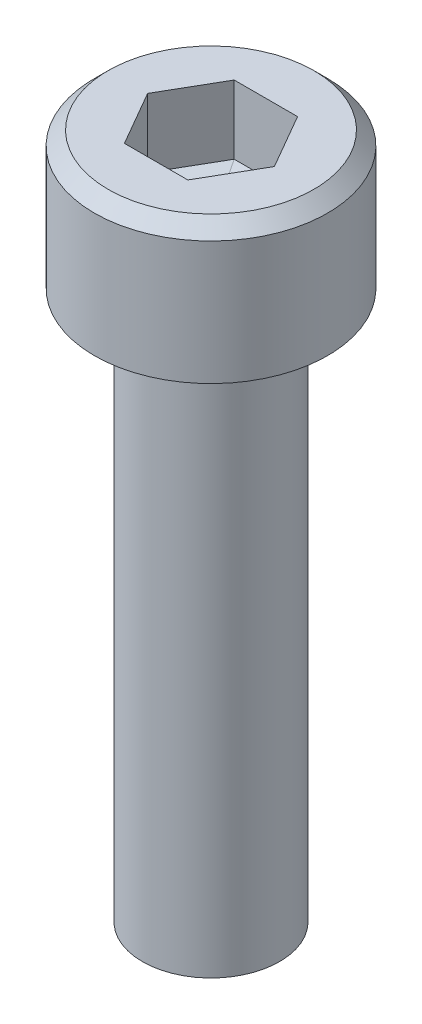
ISO-10303-21;
HEADER;
FILE_DESCRIPTION(('STEP AP214'),'2;1');
FILE_NAME('part.step','',(''),(''),'','','');
FILE_SCHEMA(('AUTOMOTIVE_DESIGN { 1 0 10303 214 1 1 1 1 }'));
ENDSEC;
DATA;
#1=APPLICATION_CONTEXT('core data for automotive mechanical design processes');
#2=APPLICATION_PROTOCOL_DEFINITION('international standard','automotive_design',2000,#1);
#3=PRODUCT_CONTEXT('',#1,'mechanical');
#4=PRODUCT('Part','Part','',(#3));
#5=PRODUCT_RELATED_PRODUCT_CATEGORY('part','',(#4));
#6=PRODUCT_DEFINITION_FORMATION('','',#4);
#7=PRODUCT_DEFINITION_CONTEXT('part definition',#1,'design');
#8=PRODUCT_DEFINITION('design','',#6,#7);
#9=PRODUCT_DEFINITION_SHAPE('','',#8);
#10=(LENGTH_UNIT() NAMED_UNIT(*) SI_UNIT(.MILLI.,.METRE.));
#11=(NAMED_UNIT(*) PLANE_ANGLE_UNIT() SI_UNIT($,.RADIAN.));
#12=(NAMED_UNIT(*) SI_UNIT($,.STERADIAN.) SOLID_ANGLE_UNIT());
#13=UNCERTAINTY_MEASURE_WITH_UNIT(LENGTH_MEASURE(1.E-05),#10,'distance_accuracy_value','');
#14=(GEOMETRIC_REPRESENTATION_CONTEXT(3) GLOBAL_UNCERTAINTY_ASSIGNED_CONTEXT((#13)) GLOBAL_UNIT_ASSIGNED_CONTEXT((#10,
#11,#12)) REPRESENTATION_CONTEXT('',''));
#15=CARTESIAN_POINT('',(0.,0.,0.));
#16=DIRECTION('',(0.,0.,1.));
#17=DIRECTION('',(1.,0.,0.));
#18=AXIS2_PLACEMENT_3D('',#15,#16,#17);
#19=CARTESIAN_POINT('',(-0.866025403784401,-2.75000000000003,0.5));
#20=DIRECTION('',(-0.210042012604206,-0.970142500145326,0.121267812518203));
#21=DIRECTION('',(0.977355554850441,-0.211603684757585,0.));
#22=AXIS2_PLACEMENT_3D('',#19,#20,#21);
#23=PLANE('',#22);
#24=DIRECTION('',(0.500000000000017,0.,0.866025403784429));
#25=VECTOR('',#24,1.);
#26=CARTESIAN_POINT('',(-2.309401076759,-2.49999999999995,0.));
#27=LINE('',#26,#25);
#28=CARTESIAN_POINT('',(-2.30940107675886,-2.49999999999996,0.));
#29=VERTEX_POINT('',#28);
#30=CARTESIAN_POINT('',(-1.15470053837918,-2.5,2.00000000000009));
#31=VERTEX_POINT('',#30);
#32=EDGE_CURVE('E106',#29,#31,#27,.T.);
#33=ORIENTED_EDGE('',*,*,#32,.T.);
#34=DIRECTION('',(0.488677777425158,-0.211603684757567,-0.846414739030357));
#35=VECTOR('',#34,1.);
#36=CARTESIAN_POINT('',(-1.15470053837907,-2.50000000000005,2.00000000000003));
#37=LINE('',#36,#35);
#38=CARTESIAN_POINT('',(0.,-3.00000000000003,0.));
#39=VERTEX_POINT('',#38);
#40=EDGE_CURVE('E105',#31,#39,#37,.T.);
#41=ORIENTED_EDGE('',*,*,#40,.T.);
#42=DIRECTION('',(0.977355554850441,-0.211603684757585,0.));
#43=VECTOR('',#42,1.);
#44=CARTESIAN_POINT('',(-0.878951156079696,-2.80970149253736,0.));
#45=LINE('',#44,#43);
#46=EDGE_CURVE('E70',#39,#29,#45,.F.);
#47=ORIENTED_EDGE('',*,*,#46,.T.);
#48=EDGE_LOOP('',(#33,#41,#47));
#49=FACE_BOUND('',#48,.T.);
#50=ADVANCED_FACE('F16',(#49),#23,.F.);
#51=CARTESIAN_POINT('',(-0.866025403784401,-2.75000000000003,-0.5));
#52=DIRECTION('',(-0.210042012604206,-0.970142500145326,-0.121267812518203));
#53=DIRECTION('',(0.977355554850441,-0.211603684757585,0.));
#54=AXIS2_PLACEMENT_3D('',#51,#52,#53);
#55=PLANE('',#54);
#56=DIRECTION('',(-0.500000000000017,0.,0.866025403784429));
#57=VECTOR('',#56,1.);
#58=CARTESIAN_POINT('',(-1.154700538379,-2.50000000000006,-2.00000000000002));
#59=LINE('',#58,#57);
#60=CARTESIAN_POINT('',(-1.15470053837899,-2.50000000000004,-2.));
#61=VERTEX_POINT('',#60);
#62=EDGE_CURVE('E78',#61,#29,#59,.T.);
#63=ORIENTED_EDGE('',*,*,#62,.T.);
#64=ORIENTED_EDGE('',*,*,#46,.F.);
#65=DIRECTION('',(-0.488677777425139,0.21160368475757,-0.846414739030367));
#66=VECTOR('',#65,1.);
#67=CARTESIAN_POINT('',(0.,-3.00000000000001,0.));
#68=LINE('',#67,#66);
#69=EDGE_CURVE('E75',#39,#61,#68,.T.);
#70=ORIENTED_EDGE('',*,*,#69,.T.);
#71=EDGE_LOOP('',(#63,#64,#70));
#72=FACE_BOUND('',#71,.T.);
#73=ADVANCED_FACE('F74',(#72),#55,.F.);
#74=CARTESIAN_POINT('',(0.,-2.75000000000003,-1.));
#75=DIRECTION('',(0.,-0.970142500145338,-0.242535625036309));
#76=DIRECTION('',(0.,0.242535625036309,-0.970142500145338));
#77=AXIS2_PLACEMENT_3D('',#74,#75,#76);
#78=PLANE('',#77);
#79=DIRECTION('',(1.,0.,0.));
#80=VECTOR('',#79,1.);
#81=CARTESIAN_POINT('',(1.154700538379,-2.50000000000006,-2.00000000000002));
#82=LINE('',#81,#80);
#83=CARTESIAN_POINT('',(1.15470053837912,-2.50000000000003,-2.00000000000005));
#84=VERTEX_POINT('',#83);
#85=EDGE_CURVE('E87',#84,#61,#82,.F.);
#86=ORIENTED_EDGE('',*,*,#85,.T.);
#87=ORIENTED_EDGE('',*,*,#69,.F.);
#88=DIRECTION('',(0.488677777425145,0.211603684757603,-0.846414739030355));
#89=VECTOR('',#88,1.);
#90=CARTESIAN_POINT('',(0.,-3.00000000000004,0.));
#91=LINE('',#90,#89);
#92=EDGE_CURVE('E84',#39,#84,#91,.T.);
#93=ORIENTED_EDGE('',*,*,#92,.T.);
#94=EDGE_LOOP('',(#86,#87,#93));
#95=FACE_BOUND('',#94,.T.);
#96=ADVANCED_FACE('F83',(#95),#78,.F.);
#97=CARTESIAN_POINT('',(0.866025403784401,-2.75000000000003,-0.5));
#98=DIRECTION('',(0.210042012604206,-0.970142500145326,-0.121267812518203));
#99=DIRECTION('',(0.977355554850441,0.211603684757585,0.));
#100=AXIS2_PLACEMENT_3D('',#97,#98,#99);
#101=PLANE('',#100);
#102=DIRECTION('',(-0.500000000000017,0.,-0.866025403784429));
#103=VECTOR('',#102,1.);
#104=CARTESIAN_POINT('',(2.309401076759,-2.49999999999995,0.));
#105=LINE('',#104,#103);
#106=CARTESIAN_POINT('',(2.30940107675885,-2.49999999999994,0.));
#107=VERTEX_POINT('',#106);
#108=EDGE_CURVE('E95',#107,#84,#105,.T.);
#109=ORIENTED_EDGE('',*,*,#108,.T.);
#110=ORIENTED_EDGE('',*,*,#92,.F.);
#111=DIRECTION('',(0.977355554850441,0.211603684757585,0.));
#112=VECTOR('',#111,1.);
#113=CARTESIAN_POINT('',(0.878951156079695,-2.80970149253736,0.));
#114=LINE('',#113,#112);
#115=EDGE_CURVE('E92',#39,#107,#114,.T.);
#116=ORIENTED_EDGE('',*,*,#115,.T.);
#117=EDGE_LOOP('',(#109,#110,#116));
#118=FACE_BOUND('',#117,.T.);
#119=ADVANCED_FACE('F91',(#118),#101,.F.);
#120=CARTESIAN_POINT('',(0.866025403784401,-2.75000000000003,0.5));
#121=DIRECTION('',(0.210042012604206,-0.970142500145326,0.121267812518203));
#122=DIRECTION('',(0.977355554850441,0.211603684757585,0.));
#123=AXIS2_PLACEMENT_3D('',#120,#121,#122);
#124=PLANE('',#123);
#125=DIRECTION('',(0.500000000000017,0.,-0.866025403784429));
#126=VECTOR('',#125,1.);
#127=CARTESIAN_POINT('',(1.154700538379,-2.49999999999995,1.99999999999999));
#128=LINE('',#127,#126);
#129=CARTESIAN_POINT('',(1.154700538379,-2.50000000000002,2.00000000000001));
#130=VERTEX_POINT('',#129);
#131=EDGE_CURVE('E102',#130,#107,#128,.T.);
#132=ORIENTED_EDGE('',*,*,#131,.T.);
#133=ORIENTED_EDGE('',*,*,#115,.F.);
#134=DIRECTION('',(0.488677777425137,0.21160368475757,0.846414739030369));
#135=VECTOR('',#134,1.);
#136=CARTESIAN_POINT('',(0.,-3.,0.));
#137=LINE('',#136,#135);
#138=EDGE_CURVE('E100',#39,#130,#137,.T.);
#139=ORIENTED_EDGE('',*,*,#138,.T.);
#140=EDGE_LOOP('',(#132,#133,#139));
#141=FACE_BOUND('',#140,.T.);
#142=ADVANCED_FACE('F98',(#141),#124,.F.);
#143=CARTESIAN_POINT('',(0.,-2.75000000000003,1.));
#144=DIRECTION('',(0.,-0.970142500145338,0.242535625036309));
#145=DIRECTION('',(0.,-0.242535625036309,-0.970142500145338));
#146=AXIS2_PLACEMENT_3D('',#143,#144,#145);
#147=PLANE('',#146);
#148=DIRECTION('',(1.,0.,0.));
#149=VECTOR('',#148,1.);
#150=CARTESIAN_POINT('',(-1.154700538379,-2.50000000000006,1.99999999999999));
#151=LINE('',#150,#149);
#152=EDGE_CURVE('E112',#31,#130,#151,.T.);
#153=ORIENTED_EDGE('',*,*,#152,.T.);
#154=ORIENTED_EDGE('',*,*,#138,.F.);
#155=ORIENTED_EDGE('',*,*,#40,.F.);
#156=EDGE_LOOP('',(#153,#154,#155));
#157=FACE_BOUND('',#156,.T.);
#158=ADVANCED_FACE('F111',(#157),#147,.F.);
#159=CARTESIAN_POINT('',(-2.309401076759,0.,0.));
#160=DIRECTION('',(-0.866025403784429,0.,0.500000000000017));
#161=DIRECTION('',(0.500000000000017,0.,0.866025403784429));
#162=AXIS2_PLACEMENT_3D('',#159,#160,#161);
#163=PLANE('',#162);
#164=DIRECTION('',(0.,-1.,0.));
#165=VECTOR('',#164,1.);
#166=CARTESIAN_POINT('',(-1.15470053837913,0.,1.99999999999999));
#167=LINE('',#166,#165);
#168=CARTESIAN_POINT('',(-1.15470053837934,0.,2.00000000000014));
#169=VERTEX_POINT('',#168);
#170=EDGE_CURVE('E148',#169,#31,#167,.T.);
#171=ORIENTED_EDGE('',*,*,#170,.T.);
#172=ORIENTED_EDGE('',*,*,#32,.F.);
#173=DIRECTION('',(0.,1.,0.));
#174=VECTOR('',#173,1.);
#175=CARTESIAN_POINT('',(-2.30940107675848,0.,2.79290479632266E-13));
#176=LINE('',#175,#174);
#177=CARTESIAN_POINT('',(-2.3094010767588,0.,1.444471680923E-13));
#178=VERTEX_POINT('',#177);
#179=EDGE_CURVE('E159',#29,#178,#176,.T.);
#180=ORIENTED_EDGE('',*,*,#179,.T.);
#181=DIRECTION('',(-0.500000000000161,0.,-0.866025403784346));
#182=VECTOR('',#181,1.);
#183=CARTESIAN_POINT('',(-1.15470053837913,0.,2.00000000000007));
#184=LINE('',#183,#182);
#185=EDGE_CURVE('E143',#169,#178,#184,.T.);
#186=ORIENTED_EDGE('',*,*,#185,.F.);
#187=EDGE_LOOP('',(#171,#172,#180,#186));
#188=FACE_BOUND('',#187,.T.);
#189=ADVANCED_FACE('F164',(#188),#163,.F.);
#190=CARTESIAN_POINT('',(-1.154700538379,0.,-2.00000000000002));
#191=DIRECTION('',(-0.866025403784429,0.,-0.500000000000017));
#192=DIRECTION('',(-0.500000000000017,0.,0.866025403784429));
#193=AXIS2_PLACEMENT_3D('',#190,#191,#192);
#194=PLANE('',#193);
#195=ORIENTED_EDGE('',*,*,#179,.F.);
#196=ORIENTED_EDGE('',*,*,#62,.F.);
#197=DIRECTION('',(0.,1.,0.));
#198=VECTOR('',#197,1.);
#199=CARTESIAN_POINT('',(-1.154700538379,0.,-2.00000000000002));
#200=LINE('',#199,#198);
#201=CARTESIAN_POINT('',(-1.154700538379,0.,-2.00000000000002));
#202=VERTEX_POINT('',#201);
#203=EDGE_CURVE('E156',#61,#202,#200,.T.);
#204=ORIENTED_EDGE('',*,*,#203,.T.);
#205=DIRECTION('',(0.500000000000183,0.,-0.866025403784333));
#206=VECTOR('',#205,1.);
#207=CARTESIAN_POINT('',(-2.30940107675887,0.,0.));
#208=LINE('',#207,#206);
#209=EDGE_CURVE('E140',#178,#202,#208,.T.);
#210=ORIENTED_EDGE('',*,*,#209,.F.);
#211=EDGE_LOOP('',(#195,#196,#204,#210));
#212=FACE_BOUND('',#211,.T.);
#213=ADVANCED_FACE('F167',(#212),#194,.F.);
#214=CARTESIAN_POINT('',(1.154700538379,0.,-2.00000000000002));
#215=DIRECTION('',(0.,0.,-1.));
#216=DIRECTION('',(0.,1.,0.));
#217=AXIS2_PLACEMENT_3D('',#214,#215,#216);
#218=PLANE('',#217);
#219=ORIENTED_EDGE('',*,*,#203,.F.);
#220=ORIENTED_EDGE('',*,*,#85,.F.);
#221=DIRECTION('',(0.,1.,0.));
#222=VECTOR('',#221,1.);
#223=CARTESIAN_POINT('',(1.15470053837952,0.,-2.00000000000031));
#224=LINE('',#223,#222);
#225=CARTESIAN_POINT('',(1.15470053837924,0.,-2.00000000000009));
#226=VERTEX_POINT('',#225);
#227=EDGE_CURVE('E153',#84,#226,#224,.T.);
#228=ORIENTED_EDGE('',*,*,#227,.T.);
#229=DIRECTION('',(1.,0.,0.));
#230=VECTOR('',#229,1.);
#231=CARTESIAN_POINT('',(0.,0.,-2.00000000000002));
#232=LINE('',#231,#230);
#233=EDGE_CURVE('E137',#202,#226,#232,.T.);
#234=ORIENTED_EDGE('',*,*,#233,.F.);
#235=EDGE_LOOP('',(#219,#220,#228,#234));
#236=FACE_BOUND('',#235,.T.);
#237=ADVANCED_FACE('F266',(#236),#218,.F.);
#238=CARTESIAN_POINT('',(2.309401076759,0.,0.));
#239=DIRECTION('',(0.866025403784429,0.,-0.500000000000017));
#240=DIRECTION('',(-0.500000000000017,0.,-0.866025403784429));
#241=AXIS2_PLACEMENT_3D('',#238,#239,#240);
#242=PLANE('',#241);
#243=ORIENTED_EDGE('',*,*,#227,.F.);
#244=ORIENTED_EDGE('',*,*,#108,.F.);
#245=DIRECTION('',(0.,1.,0.));
#246=VECTOR('',#245,1.);
#247=CARTESIAN_POINT('',(2.30940107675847,0.,-2.92300905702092E-13));
#248=LINE('',#247,#246);
#249=CARTESIAN_POINT('',(2.3094010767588,0.,-1.47794642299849E-13));
#250=VERTEX_POINT('',#249);
#251=EDGE_CURVE('E150',#107,#250,#248,.T.);
#252=ORIENTED_EDGE('',*,*,#251,.T.);
#253=DIRECTION('',(0.500000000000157,0.,0.866025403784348));
#254=VECTOR('',#253,1.);
#255=CARTESIAN_POINT('',(1.15470053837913,0.,-2.0000000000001));
#256=LINE('',#255,#254);
#257=EDGE_CURVE('E134',#226,#250,#256,.T.);
#258=ORIENTED_EDGE('',*,*,#257,.F.);
#259=EDGE_LOOP('',(#243,#244,#252,#258));
#260=FACE_BOUND('',#259,.T.);
#261=ADVANCED_FACE('F185',(#260),#242,.F.);
#262=CARTESIAN_POINT('',(1.154700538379,0.,1.99999999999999));
#263=DIRECTION('',(0.866025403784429,0.,0.500000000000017));
#264=DIRECTION('',(0.500000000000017,0.,-0.866025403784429));
#265=AXIS2_PLACEMENT_3D('',#262,#263,#264);
#266=PLANE('',#265);
#267=ORIENTED_EDGE('',*,*,#251,.F.);
#268=ORIENTED_EDGE('',*,*,#131,.F.);
#269=DIRECTION('',(0.,-1.,0.));
#270=VECTOR('',#269,1.);
#271=CARTESIAN_POINT('',(1.154700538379,0.,1.99999999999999));
#272=LINE('',#271,#270);
#273=CARTESIAN_POINT('',(1.154700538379,0.,1.99999999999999));
#274=VERTEX_POINT('',#273);
#275=EDGE_CURVE('E34',#130,#274,#272,.F.);
#276=ORIENTED_EDGE('',*,*,#275,.T.);
#277=DIRECTION('',(-0.500000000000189,0.,0.86602540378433));
#278=VECTOR('',#277,1.);
#279=CARTESIAN_POINT('',(2.30940107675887,0.,0.));
#280=LINE('',#279,#278);
#281=EDGE_CURVE('E131',#250,#274,#280,.T.);
#282=ORIENTED_EDGE('',*,*,#281,.F.);
#283=EDGE_LOOP('',(#267,#268,#276,#282));
#284=FACE_BOUND('',#283,.T.);
#285=ADVANCED_FACE('F175',(#284),#266,.F.);
#286=CARTESIAN_POINT('',(-1.154700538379,0.,1.99999999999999));
#287=DIRECTION('',(0.,0.,1.));
#288=DIRECTION('',(0.,-1.,0.));
#289=AXIS2_PLACEMENT_3D('',#286,#287,#288);
#290=PLANE('',#289);
#291=ORIENTED_EDGE('',*,*,#275,.F.);
#292=ORIENTED_EDGE('',*,*,#152,.F.);
#293=ORIENTED_EDGE('',*,*,#170,.F.);
#294=DIRECTION('',(1.,0.,0.));
#295=VECTOR('',#294,1.);
#296=CARTESIAN_POINT('',(0.,0.,1.99999999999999));
#297=LINE('',#296,#295);
#298=EDGE_CURVE('E127',#274,#169,#297,.F.);
#299=ORIENTED_EDGE('',*,*,#298,.F.);
#300=EDGE_LOOP('',(#291,#292,#293,#299));
#301=FACE_BOUND('',#300,.T.);
#302=ADVANCED_FACE('F173',(#301),#290,.F.);
#303=CARTESIAN_POINT('',(0.,0.,0.));
#304=DIRECTION('',(0.,1.,0.));
#305=DIRECTION('',(0.,0.,1.));
#306=AXIS2_PLACEMENT_3D('',#303,#304,#305);
#307=PLANE('',#306);
#308=CARTESIAN_POINT('',(0.,0.,0.));
#309=DIRECTION('',(0.,-1.,0.));
#310=DIRECTION('',(0.,0.,-1.));
#311=AXIS2_PLACEMENT_3D('',#308,#309,#310);
#312=CIRCLE('',#311,3.75000000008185);
#313=CARTESIAN_POINT('',(0.,0.,-3.75000000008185));
#314=VERTEX_POINT('',#313);
#315=EDGE_CURVE('E19',#314,#314,#312,.T.);
#316=ORIENTED_EDGE('',*,*,#315,.F.);
#317=EDGE_LOOP('',(#316));
#318=FACE_BOUND('',#317,.T.);
#319=ORIENTED_EDGE('',*,*,#281,.T.);
#320=ORIENTED_EDGE('',*,*,#298,.T.);
#321=ORIENTED_EDGE('',*,*,#185,.T.);
#322=ORIENTED_EDGE('',*,*,#209,.T.);
#323=ORIENTED_EDGE('',*,*,#233,.T.);
#324=ORIENTED_EDGE('',*,*,#257,.T.);
#325=EDGE_LOOP('',(#319,#320,#321,#322,#323,#324));
#326=FACE_BOUND('',#325,.T.);
#327=ADVANCED_FACE('F171',(#318,#326),#307,.T.);
#328=CARTESIAN_POINT('',(0.,-0.49999999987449,0.));
#329=DIRECTION('',(0.,-1.,0.));
#330=DIRECTION('',(0.,0.,-1.));
#331=AXIS2_PLACEMENT_3D('',#328,#329,#330);
#332=CONICAL_SURFACE('',#331,4.2499999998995,0.785398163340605);
#333=CARTESIAN_POINT('',(0.,-0.500000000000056,0.));
#334=DIRECTION('',(0.,1.,0.));
#335=DIRECTION('',(0.,0.,1.));
#336=AXIS2_PLACEMENT_3D('',#333,#334,#335);
#337=CIRCLE('',#336,4.25);
#338=CARTESIAN_POINT('',(0.,-0.500000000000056,4.25));
#339=VERTEX_POINT('',#338);
#340=EDGE_CURVE('E119',#339,#339,#337,.F.);
#341=ORIENTED_EDGE('',*,*,#340,.F.);
#342=EDGE_LOOP('',(#341));
#343=FACE_BOUND('',#342,.T.);
#344=ORIENTED_EDGE('',*,*,#315,.T.);
#345=EDGE_LOOP('',(#344));
#346=FACE_BOUND('',#345,.T.);
#347=ADVANCED_FACE('F182',(#343,#346),#332,.T.);
#348=CARTESIAN_POINT('',(0.,-26.25,0.));
#349=DIRECTION('',(0.,1.,0.));
#350=DIRECTION('',(0.,0.,1.));
#351=AXIS2_PLACEMENT_3D('',#348,#349,#350);
#352=CYLINDRICAL_SURFACE('',#351,4.25);
#353=ORIENTED_EDGE('',*,*,#340,.T.);
#354=EDGE_LOOP('',(#353));
#355=FACE_BOUND('',#354,.T.);
#356=CARTESIAN_POINT('',(0.,-5.,0.));
#357=DIRECTION('',(0.,1.,0.));
#358=DIRECTION('',(0.,0.,1.));
#359=AXIS2_PLACEMENT_3D('',#356,#357,#358);
#360=CIRCLE('',#359,4.25);
#361=CARTESIAN_POINT('',(0.,-5.,4.25));
#362=VERTEX_POINT('',#361);
#363=EDGE_CURVE('E117',#362,#362,#360,.T.);
#364=ORIENTED_EDGE('',*,*,#363,.T.);
#365=EDGE_LOOP('',(#364));
#366=FACE_BOUND('',#365,.T.);
#367=ADVANCED_FACE('F202',(#355,#366),#352,.T.);
#368=CARTESIAN_POINT('',(0.,-25.,0.));
#369=DIRECTION('',(0.,1.,0.));
#370=DIRECTION('',(0.,0.,1.));
#371=AXIS2_PLACEMENT_3D('',#368,#369,#370);
#372=PLANE('',#371);
#373=CARTESIAN_POINT('',(0.,-25.,0.));
#374=DIRECTION('',(0.,1.,0.));
#375=DIRECTION('',(0.,0.,1.));
#376=AXIS2_PLACEMENT_3D('',#373,#374,#375);
#377=CIRCLE('',#376,2.5);
#378=CARTESIAN_POINT('',(0.,-25.,2.5));
#379=VERTEX_POINT('',#378);
#380=EDGE_CURVE('E25',#379,#379,#377,.T.);
#381=ORIENTED_EDGE('',*,*,#380,.F.);
#382=EDGE_LOOP('',(#381));
#383=FACE_BOUND('',#382,.T.);
#384=ADVANCED_FACE('F195',(#383),#372,.F.);
#385=CARTESIAN_POINT('',(0.,-5.,0.));
#386=DIRECTION('',(0.,1.,0.));
#387=DIRECTION('',(0.,0.,1.));
#388=AXIS2_PLACEMENT_3D('',#385,#386,#387);
#389=PLANE('',#388);
#390=ORIENTED_EDGE('',*,*,#363,.F.);
#391=EDGE_LOOP('',(#390));
#392=FACE_BOUND('',#391,.T.);
#393=CARTESIAN_POINT('',(0.,-5.,0.));
#394=DIRECTION('',(0.,1.,0.));
#395=DIRECTION('',(0.,0.,1.));
#396=AXIS2_PLACEMENT_3D('',#393,#394,#395);
#397=CIRCLE('',#396,2.5);
#398=CARTESIAN_POINT('',(0.,-5.,2.5));
#399=VERTEX_POINT('',#398);
#400=EDGE_CURVE('E11',#399,#399,#397,.F.);
#401=ORIENTED_EDGE('',*,*,#400,.F.);
#402=EDGE_LOOP('',(#401));
#403=FACE_BOUND('',#402,.T.);
#404=ADVANCED_FACE('F189',(#392,#403),#389,.F.);
#405=CARTESIAN_POINT('',(0.,-26.25,0.));
#406=DIRECTION('',(0.,1.,0.));
#407=DIRECTION('',(0.,0.,1.));
#408=AXIS2_PLACEMENT_3D('',#405,#406,#407);
#409=CYLINDRICAL_SURFACE('',#408,2.5);
#410=ORIENTED_EDGE('',*,*,#400,.T.);
#411=EDGE_LOOP('',(#410));
#412=FACE_BOUND('',#411,.T.);
#413=ORIENTED_EDGE('',*,*,#380,.T.);
#414=EDGE_LOOP('',(#413));
#415=FACE_BOUND('',#414,.T.);
#416=ADVANCED_FACE('F187',(#412,#415),#409,.T.);
#417=CLOSED_SHELL('',(#50,#73,#96,#119,#142,#158,#189,#213,#237,#261,#285,#302,#327,#347,#367,
#384,#404,#416));
#418=MANIFOLD_SOLID_BREP('B1',#417);
#419=ADVANCED_BREP_SHAPE_REPRESENTATION('',(#18,#418),#14);
#420=SHAPE_DEFINITION_REPRESENTATION(#9,#419);
ENDSEC;
END-ISO-10303-21;
